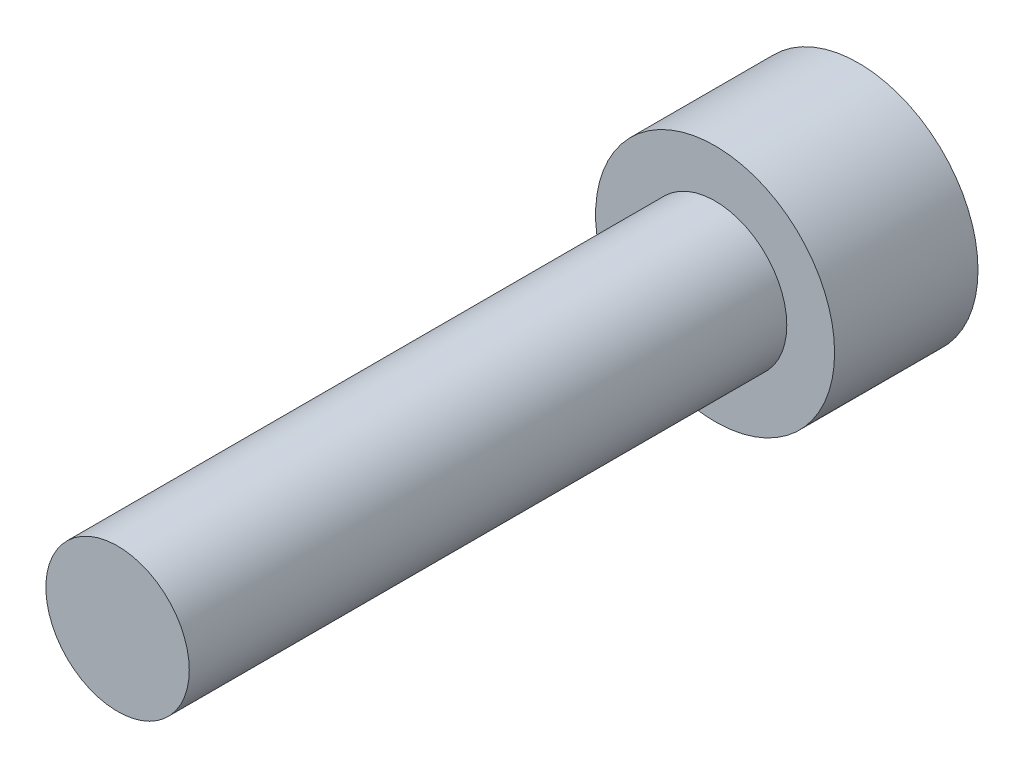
from build123d import *

# Parameters (mm, degrees)
HEX_2_DEPTH = 5


with BuildPart() as part:
    # Sketch6 → Revolve1 (revolve)
    with BuildSketch(Plane(origin=(0, 0, 0), x_dir=(0, 0, -1), z_dir=(1, 0, 0)), mode=Mode.PRIVATE) as revolve1_sk:
        Polygon((-25, 0), (-25, -3), (0, -3), (0, -5), (6, -5), (6, 0), align=None)
    revolve(revolve1_sk.sketch.rotate(Axis((0, 0, 25), (0, 0, -1)), 270), axis=Axis((0, 0, 25), (0, 0, -1)))

    # Sketch7 → HEX 2 (cut)
    with BuildSketch(Plane(origin=(0, 0, -6), x_dir=(-1, 0, 0), z_dir=(0, 0, -1))):
        Polygon((-2.5, 1.443375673), (-2.5, -1.443375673), (0, -2.886751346), (2.5, -1.443375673), (2.5, 1.443375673), (0, 2.886751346), align=None)
    extrude(amount=-HEX_2_DEPTH, mode=Mode.SUBTRACT)


solid = part.part
